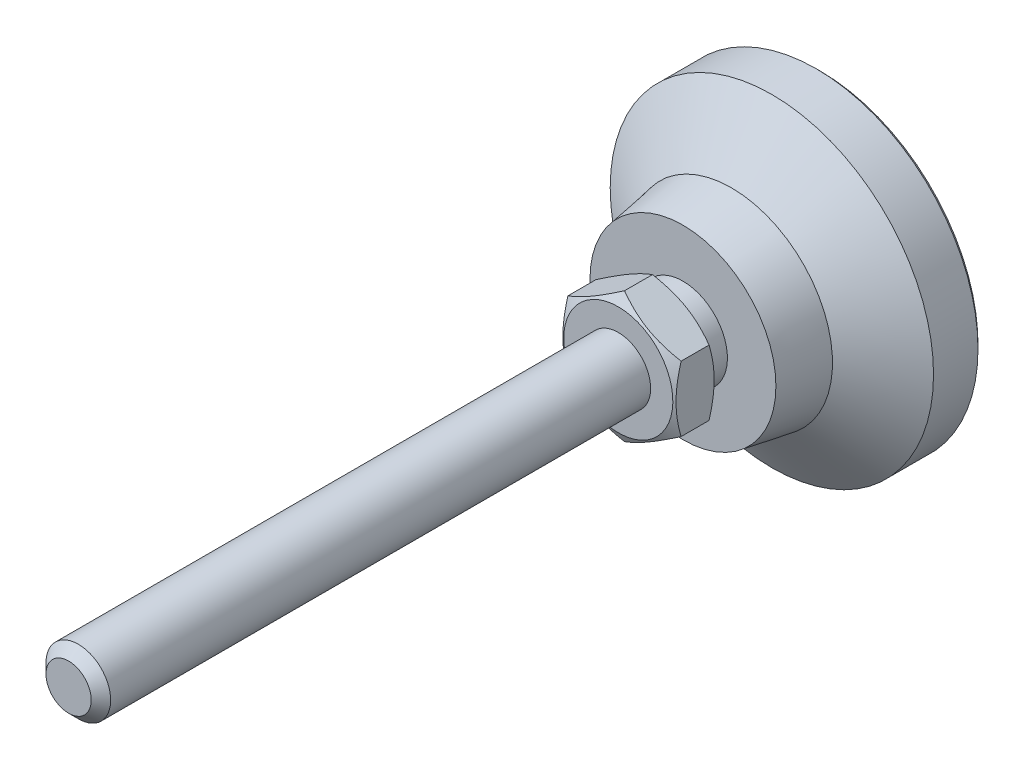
ISO-10303-21;
HEADER;
FILE_DESCRIPTION(('STEP AP214'),'2;1');
FILE_NAME('part.step','',(''),(''),'','','');
FILE_SCHEMA(('AUTOMOTIVE_DESIGN { 1 0 10303 214 1 1 1 1 }'));
ENDSEC;
DATA;
#1=APPLICATION_CONTEXT('core data for automotive mechanical design processes');
#2=APPLICATION_PROTOCOL_DEFINITION('international standard','automotive_design',2000,#1);
#3=PRODUCT_CONTEXT('',#1,'mechanical');
#4=PRODUCT('Part','Part','',(#3));
#5=PRODUCT_RELATED_PRODUCT_CATEGORY('part','',(#4));
#6=PRODUCT_DEFINITION_FORMATION('','',#4);
#7=PRODUCT_DEFINITION_CONTEXT('part definition',#1,'design');
#8=PRODUCT_DEFINITION('design','',#6,#7);
#9=PRODUCT_DEFINITION_SHAPE('','',#8);
#10=(LENGTH_UNIT() NAMED_UNIT(*) SI_UNIT(.MILLI.,.METRE.));
#11=(NAMED_UNIT(*) PLANE_ANGLE_UNIT() SI_UNIT($,.RADIAN.));
#12=(NAMED_UNIT(*) SI_UNIT($,.STERADIAN.) SOLID_ANGLE_UNIT());
#13=UNCERTAINTY_MEASURE_WITH_UNIT(LENGTH_MEASURE(1.E-05),#10,'distance_accuracy_value','');
#14=(GEOMETRIC_REPRESENTATION_CONTEXT(3) GLOBAL_UNCERTAINTY_ASSIGNED_CONTEXT((#13)) GLOBAL_UNIT_ASSIGNED_CONTEXT((#10,
#11,#12)) REPRESENTATION_CONTEXT('',''));
#15=CARTESIAN_POINT('',(0.,0.,0.));
#16=DIRECTION('',(0.,0.,1.));
#17=DIRECTION('',(1.,0.,0.));
#18=AXIS2_PLACEMENT_3D('',#15,#16,#17);
#19=CARTESIAN_POINT('',(-5.49999999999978,0.,20.));
#20=DIRECTION('',(0.,0.,1.));
#21=DIRECTION('',(0.,-1.,0.));
#22=AXIS2_PLACEMENT_3D('',#19,#20,#21);
#23=PLANE('',#22);
#24=CARTESIAN_POINT('',(0.,0.,20.));
#25=DIRECTION('',(0.,0.,-1.));
#26=DIRECTION('',(0.,1.,0.));
#27=AXIS2_PLACEMENT_3D('',#24,#25,#26);
#28=CIRCLE('',#27,5.49999999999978);
#29=CARTESIAN_POINT('',(0.,5.49999999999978,20.));
#30=VERTEX_POINT('',#29);
#31=EDGE_CURVE('E98',#30,#30,#28,.T.);
#32=ORIENTED_EDGE('',*,*,#31,.F.);
#33=EDGE_LOOP('',(#32));
#34=FACE_BOUND('',#33,.T.);
#35=CARTESIAN_POINT('',(0.,0.,20.));
#36=DIRECTION('',(0.,0.,-1.));
#37=DIRECTION('',(0.,1.,0.));
#38=AXIS2_PLACEMENT_3D('',#35,#36,#37);
#39=CIRCLE('',#38,6.75);
#40=CARTESIAN_POINT('',(0.,6.75,20.));
#41=VERTEX_POINT('',#40);
#42=EDGE_CURVE('E73',#41,#41,#39,.T.);
#43=ORIENTED_EDGE('',*,*,#42,.T.);
#44=EDGE_LOOP('',(#43));
#45=FACE_BOUND('',#44,.T.);
#46=ADVANCED_FACE('F14',(#34,#45),#23,.F.);
#47=CARTESIAN_POINT('',(0.,0.,-1.00000000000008));
#48=DIRECTION('',(0.,0.,-1.));
#49=DIRECTION('',(0.,1.,0.));
#50=AXIS2_PLACEMENT_3D('',#47,#48,#49);
#51=CYLINDRICAL_SURFACE('',#50,20.);
#52=CARTESIAN_POINT('',(0.,0.,0.500000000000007));
#53=DIRECTION('',(0.,0.,-1.));
#54=DIRECTION('',(0.,1.,0.));
#55=AXIS2_PLACEMENT_3D('',#52,#53,#54);
#56=CIRCLE('',#55,20.);
#57=CARTESIAN_POINT('',(0.,20.,0.500000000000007));
#58=VERTEX_POINT('',#57);
#59=EDGE_CURVE('E9',#58,#58,#56,.F.);
#60=ORIENTED_EDGE('',*,*,#59,.T.);
#61=EDGE_LOOP('',(#60));
#62=FACE_BOUND('',#61,.T.);
#63=CARTESIAN_POINT('',(0.,0.,6.));
#64=DIRECTION('',(0.,0.,-1.));
#65=DIRECTION('',(0.,1.,0.));
#66=AXIS2_PLACEMENT_3D('',#63,#64,#65);
#67=CIRCLE('',#66,20.);
#68=CARTESIAN_POINT('',(0.,20.,6.));
#69=VERTEX_POINT('',#68);
#70=EDGE_CURVE('E110',#69,#69,#67,.T.);
#71=ORIENTED_EDGE('',*,*,#70,.T.);
#72=EDGE_LOOP('',(#71));
#73=FACE_BOUND('',#72,.T.);
#74=ADVANCED_FACE('F131',(#62,#73),#51,.T.);
#75=CARTESIAN_POINT('',(0.,0.,11.));
#76=DIRECTION('',(0.,0.,-1.));
#77=DIRECTION('',(0.,1.,0.));
#78=AXIS2_PLACEMENT_3D('',#75,#76,#77);
#79=CONICAL_SURFACE('',#78,12.5,0.98279372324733);
#80=ORIENTED_EDGE('',*,*,#70,.F.);
#81=EDGE_LOOP('',(#80));
#82=FACE_BOUND('',#81,.T.);
#83=CARTESIAN_POINT('',(0.,0.,11.));
#84=DIRECTION('',(0.,0.,-1.));
#85=DIRECTION('',(0.,1.,0.));
#86=AXIS2_PLACEMENT_3D('',#83,#84,#85);
#87=CIRCLE('',#86,12.5);
#88=CARTESIAN_POINT('',(0.,12.5,11.));
#89=VERTEX_POINT('',#88);
#90=EDGE_CURVE('E107',#89,#89,#87,.T.);
#91=ORIENTED_EDGE('',*,*,#90,.T.);
#92=EDGE_LOOP('',(#91));
#93=FACE_BOUND('',#92,.T.);
#94=ADVANCED_FACE('F138',(#82,#93),#79,.T.);
#95=CARTESIAN_POINT('',(0.,0.,17.));
#96=DIRECTION('',(0.,0.,-1.));
#97=DIRECTION('',(0.,1.,0.));
#98=AXIS2_PLACEMENT_3D('',#95,#96,#97);
#99=CONICAL_SURFACE('',#98,11.5,0.165148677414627);
#100=ORIENTED_EDGE('',*,*,#90,.F.);
#101=EDGE_LOOP('',(#100));
#102=FACE_BOUND('',#101,.T.);
#103=CARTESIAN_POINT('',(0.,0.,17.));
#104=DIRECTION('',(0.,0.,-1.));
#105=DIRECTION('',(0.,1.,0.));
#106=AXIS2_PLACEMENT_3D('',#103,#104,#105);
#107=CIRCLE('',#106,11.5);
#108=CARTESIAN_POINT('',(0.,11.5,17.));
#109=VERTEX_POINT('',#108);
#110=EDGE_CURVE('E104',#109,#109,#107,.T.);
#111=ORIENTED_EDGE('',*,*,#110,.T.);
#112=EDGE_LOOP('',(#111));
#113=FACE_BOUND('',#112,.T.);
#114=ADVANCED_FACE('F152',(#102,#113),#99,.T.);
#115=CARTESIAN_POINT('',(-11.5,0.,17.));
#116=DIRECTION('',(0.,0.,-1.));
#117=DIRECTION('',(0.,1.,0.));
#118=AXIS2_PLACEMENT_3D('',#115,#116,#117);
#119=PLANE('',#118);
#120=ORIENTED_EDGE('',*,*,#110,.F.);
#121=EDGE_LOOP('',(#120));
#122=FACE_BOUND('',#121,.T.);
#123=CARTESIAN_POINT('',(0.,0.,17.));
#124=DIRECTION('',(0.,0.,-1.));
#125=DIRECTION('',(0.,1.,0.));
#126=AXIS2_PLACEMENT_3D('',#123,#124,#125);
#127=CIRCLE('',#126,5.49999999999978);
#128=CARTESIAN_POINT('',(0.,5.49999999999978,17.));
#129=VERTEX_POINT('',#128);
#130=EDGE_CURVE('E101',#129,#129,#127,.T.);
#131=ORIENTED_EDGE('',*,*,#130,.T.);
#132=EDGE_LOOP('',(#131));
#133=FACE_BOUND('',#132,.T.);
#134=ADVANCED_FACE('F148',(#122,#133),#119,.F.);
#135=CARTESIAN_POINT('',(0.,0.,-1.00000000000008));
#136=DIRECTION('',(0.,0.,-1.));
#137=DIRECTION('',(0.,1.,0.));
#138=AXIS2_PLACEMENT_3D('',#135,#136,#137);
#139=CYLINDRICAL_SURFACE('',#138,5.49999999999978);
#140=ORIENTED_EDGE('',*,*,#130,.F.);
#141=EDGE_LOOP('',(#140));
#142=FACE_BOUND('',#141,.T.);
#143=ORIENTED_EDGE('',*,*,#31,.T.);
#144=EDGE_LOOP('',(#143));
#145=FACE_BOUND('',#144,.T.);
#146=ADVANCED_FACE('F127',(#142,#145),#139,.T.);
#147=CARTESIAN_POINT('',(0.,0.,0.));
#148=DIRECTION('',(0.,0.,-1.));
#149=DIRECTION('',(0.,1.,0.));
#150=AXIS2_PLACEMENT_3D('',#147,#148,#149);
#151=PLANE('',#150);
#152=CARTESIAN_POINT('',(0.,0.,0.));
#153=DIRECTION('',(0.,0.,-1.));
#154=DIRECTION('',(0.,1.,0.));
#155=AXIS2_PLACEMENT_3D('',#152,#153,#154);
#156=CIRCLE('',#155,19.5);
#157=CARTESIAN_POINT('',(0.,19.5,0.));
#158=VERTEX_POINT('',#157);
#159=EDGE_CURVE('E22',#158,#158,#156,.T.);
#160=ORIENTED_EDGE('',*,*,#159,.T.);
#161=EDGE_LOOP('',(#160));
#162=FACE_BOUND('',#161,.T.);
#163=ADVANCED_FACE('F115',(#162),#151,.T.);
#164=CARTESIAN_POINT('',(0.,0.,0.));
#165=DIRECTION('',(0.,0.,1.));
#166=DIRECTION('',(0.,-1.,0.));
#167=AXIS2_PLACEMENT_3D('',#164,#165,#166);
#168=CONICAL_SURFACE('',#167,19.5,0.785398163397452);
#169=ORIENTED_EDGE('',*,*,#59,.F.);
#170=EDGE_LOOP('',(#169));
#171=FACE_BOUND('',#170,.T.);
#172=ORIENTED_EDGE('',*,*,#159,.F.);
#173=EDGE_LOOP('',(#172));
#174=FACE_BOUND('',#173,.T.);
#175=ADVANCED_FACE('F16',(#171,#174),#168,.T.);
#176=CARTESIAN_POINT('',(0.,0.,20.));
#177=DIRECTION('',(0.,0.,1.));
#178=DIRECTION('',(0.,-1.,0.));
#179=AXIS2_PLACEMENT_3D('',#176,#177,#178);
#180=CONICAL_SURFACE('',#179,6.75,1.0471975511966);
#181=CARTESIAN_POINT('',(-7.,10.8309381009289,23.5484485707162));
#182=CARTESIAN_POINT('',(-7.,10.5254090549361,23.4003398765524));
#183=CARTESIAN_POINT('',(-7.,10.2191759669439,23.2536585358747));
#184=CARTESIAN_POINT('',(-7.,9.6049271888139,22.9639538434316));
#185=CARTESIAN_POINT('',(-7.,9.29691122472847,22.8209310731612));
#186=CARTESIAN_POINT('',(-7.,8.67712322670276,22.5386219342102));
#187=CARTESIAN_POINT('',(-7.,8.36533985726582,22.3993603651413));
#188=CARTESIAN_POINT('',(-7.,7.73928460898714,22.1265696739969));
#189=CARTESIAN_POINT('',(-7.,7.42501284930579,21.9930402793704));
#190=CARTESIAN_POINT('',(-7.,6.78343496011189,21.7290953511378));
#191=CARTESIAN_POINT('',(-7.,6.45603206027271,21.5989137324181));
#192=CARTESIAN_POINT('',(-7.,5.79738748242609,21.3484635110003));
#193=CARTESIAN_POINT('',(-7.,5.46614537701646,21.228196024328));
#194=CARTESIAN_POINT('',(-7.,4.79991945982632,21.0007499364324));
#195=CARTESIAN_POINT('',(-7.,4.46494486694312,20.8935446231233));
#196=CARTESIAN_POINT('',(-7.,3.79020291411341,20.6956778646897));
#197=CARTESIAN_POINT('',(-7.,3.45043710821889,20.605011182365));
#198=CARTESIAN_POINT('',(-7.,2.7677432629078,20.4450759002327));
#199=CARTESIAN_POINT('',(-7.,2.42484292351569,20.3756922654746));
#200=CARTESIAN_POINT('',(-7.,1.90738986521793,20.290595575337));
#201=CARTESIAN_POINT('',(-7.,1.73437552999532,20.2653919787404));
#202=CARTESIAN_POINT('',(-7.,1.38749538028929,20.2218059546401));
#203=CARTESIAN_POINT('',(-7.,1.21362964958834,20.2034228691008));
#204=CARTESIAN_POINT('',(-7.,0.867540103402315,20.1740733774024));
#205=CARTESIAN_POINT('',(-7.,0.695324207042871,20.163013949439));
#206=CARTESIAN_POINT('',(-7.,0.350579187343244,20.1481859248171));
#207=CARTESIAN_POINT('',(-7.,0.178050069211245,20.1444172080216));
#208=CARTESIAN_POINT('',(-7.,-0.167013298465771,20.1442604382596));
#209=CARTESIAN_POINT('',(-7.,-0.339547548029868,20.1478724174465));
#210=CARTESIAN_POINT('',(-7.,-0.684311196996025,20.1623892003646));
#211=CARTESIAN_POINT('',(-7.,-0.856540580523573,20.1732943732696));
#212=CARTESIAN_POINT('',(-7.,-1.27121640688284,20.2081008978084));
#213=CARTESIAN_POINT('',(-7.,-1.51337499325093,20.2355046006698));
#214=CARTESIAN_POINT('',(-7.,-1.99586709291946,20.3032290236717));
#215=CARTESIAN_POINT('',(-7.,-2.23620035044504,20.3435515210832));
#216=CARTESIAN_POINT('',(-7.,-2.95420288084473,20.48175670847));
#217=CARTESIAN_POINT('',(-7.,-3.42860142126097,20.5968511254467));
#218=CARTESIAN_POINT('',(-7.,-4.13792296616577,20.7960878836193));
#219=CARTESIAN_POINT('',(-7.,-4.3765338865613,20.8678526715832));
#220=CARTESIAN_POINT('',(-7.,-4.85143755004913,21.0187495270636));
#221=CARTESIAN_POINT('',(-7.,-5.08773027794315,21.0978816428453));
#222=CARTESIAN_POINT('',(-7.,-5.55807357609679,21.2622506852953));
#223=CARTESIAN_POINT('',(-7.,-5.79212487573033,21.3474855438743));
#224=CARTESIAN_POINT('',(-7.,-6.25829408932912,21.5230658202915));
#225=CARTESIAN_POINT('',(-7.,-6.49041202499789,21.6134111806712));
#226=CARTESIAN_POINT('',(-7.,-7.03438398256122,21.8309339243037));
#227=CARTESIAN_POINT('',(-7.,-7.34553042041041,21.9598774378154));
#228=CARTESIAN_POINT('',(-7.,-7.96521129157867,22.2239128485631));
#229=CARTESIAN_POINT('',(-7.,-8.27374557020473,22.3590051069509));
#230=CARTESIAN_POINT('',(-7.,-8.88867762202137,22.6341137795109));
#231=CARTESIAN_POINT('',(-7.,-9.19507496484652,22.7741311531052));
#232=CARTESIAN_POINT('',(-7.,-9.80603817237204,23.0581132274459));
#233=CARTESIAN_POINT('',(-7.,-10.1106039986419,23.2020780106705));
#234=CARTESIAN_POINT('',(-7.,-10.7185127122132,23.4933690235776));
#235=CARTESIAN_POINT('',(-7.,-11.0218539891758,23.6406986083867));
#236=CARTESIAN_POINT('',(-7.,-11.6272367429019,23.9380068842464));
#237=CARTESIAN_POINT('',(-7.,-11.9292782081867,24.0879855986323));
#238=CARTESIAN_POINT('',(-7.,-12.8336830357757,24.5411573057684));
#239=CARTESIAN_POINT('',(-7.,-13.4344058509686,24.8476240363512));
#240=CARTESIAN_POINT('',(-7.,-14.5830259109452,25.4410667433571));
#241=CARTESIAN_POINT('',(-7.,-15.1311766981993,25.7275541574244));
#242=CARTESIAN_POINT('',(-7.,-16.2254388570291,26.3044400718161));
#243=CARTESIAN_POINT('',(-7.,-16.7715501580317,26.5948387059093));
#244=CARTESIAN_POINT('',(-7.,-17.8608477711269,27.1779057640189));
#245=CARTESIAN_POINT('',(-7.,-18.4040379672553,27.4705669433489));
#246=CARTESIAN_POINT('',(-7.,-19.4891122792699,28.0582319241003));
#247=CARTESIAN_POINT('',(-7.,-20.0309964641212,28.3532355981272));
#248=CARTESIAN_POINT('',(-7.,-20.5723989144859,28.6491148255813));
#249=B_SPLINE_CURVE_WITH_KNOTS('',3,(#181,#182,#183,#184,#185,#186,#187,#188,#189,#190,#191,
#192,#193,#194,#195,#196,#197,#198,#199,#200,#201,#202,#203,#204,#205,#206,#207,#208,#209,#210,
#211,#212,#213,#214,#215,#216,#217,#218,#219,#220,#221,#222,#223,#224,#225,#226,#227,#228,#229,
#230,#231,#232,#233,#234,#235,#236,#237,#238,#239,#240,#241,#242,#243,#244,#245,#246,#247,#248),
.UNSPECIFIED.,.F.,.F.,(4,2,2,2,2,2,2,2,2,2,2,2,2,2,2,2,2,2,2,2,2,2,2,2,2,2,2,2,2,2,2,2,2,4),(0.,
1.01861829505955,2.03739749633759,3.06176519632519,4.08608413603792,5.14296439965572,
6.19996347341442,7.2547633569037,8.30922864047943,9.35788980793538,9.88229784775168,
10.406655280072,10.924217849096,11.4417718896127,11.9593281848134,12.4769106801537,
13.2076098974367,13.9384096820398,15.400829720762,16.1482764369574,16.8957280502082,
17.6429275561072,18.3901186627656,19.4004490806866,20.4108389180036,21.4214266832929,
22.4320355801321,23.443700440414,24.4553742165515,26.4784585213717,28.3339467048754,
30.1894985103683,32.0405341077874,33.8914697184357),.UNSPECIFIED.);
#250=CARTESIAN_POINT('',(-7.,4.04145188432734,20.7695523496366));
#251=VERTEX_POINT('',#250);
#252=CARTESIAN_POINT('',(-7.,-4.04145188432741,20.7695523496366));
#253=VERTEX_POINT('',#252);
#254=EDGE_CURVE('E79',#251,#253,#249,.T.);
#255=ORIENTED_EDGE('',*,*,#254,.F.);
#256=CARTESIAN_POINT('',(0.000200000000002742,8.08301923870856,20.7696190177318));
#257=CARTESIAN_POINT('',(-0.153667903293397,7.99418356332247,20.7183374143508));
#258=CARTESIAN_POINT('',(-0.308109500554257,7.90501666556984,20.669383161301));
#259=CARTESIAN_POINT('',(-0.618246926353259,7.725958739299,20.5767703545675));
#260=CARTESIAN_POINT('',(-0.773943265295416,7.63606741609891,20.5331140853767));
#261=CARTESIAN_POINT('',(-1.24352516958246,7.36495417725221,20.4109491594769));
#262=CARTESIAN_POINT('',(-1.5592643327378,7.18266208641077,20.3414631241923));
#263=CARTESIAN_POINT('',(-2.03176224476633,6.90986528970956,20.2599825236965));
#264=CARTESIAN_POINT('',(-2.18710922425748,6.82017566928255,20.2367710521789));
#265=CARTESIAN_POINT('',(-2.49850511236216,6.64039116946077,20.1978487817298));
#266=CARTESIAN_POINT('',(-2.6545539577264,6.55029632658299,20.1821373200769));
#267=CARTESIAN_POINT('',(-2.96692267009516,6.36995016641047,20.1586154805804));
#268=CARTESIAN_POINT('',(-3.12324202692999,6.27969914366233,20.1507961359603));
#269=CARTESIAN_POINT('',(-3.43601650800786,6.09911871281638,20.1432178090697));
#270=CARTESIAN_POINT('',(-3.59247162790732,6.00878930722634,20.1434585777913));
#271=CARTESIAN_POINT('',(-4.02110687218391,5.76131663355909,20.1551972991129));
#272=CARTESIAN_POINT('',(-4.29314668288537,5.6042543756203,20.1749033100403));
#273=CARTESIAN_POINT('',(-4.83541944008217,5.29117305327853,20.2373910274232));
#274=CARTESIAN_POINT('',(-5.10565047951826,5.13515508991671,20.2801940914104));
#275=CARTESIAN_POINT('',(-5.64901454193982,4.82144370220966,20.3871892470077));
#276=CARTESIAN_POINT('',(-5.92207900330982,4.66378986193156,20.4518346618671));
#277=CARTESIAN_POINT('',(-6.46413578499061,4.35083323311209,20.5985536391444));
#278=CARTESIAN_POINT('',(-6.73313504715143,4.19552643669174,20.6805927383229));
#279=CARTESIAN_POINT('',(-7.0002,4.0413364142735,20.7696190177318));
#280=B_SPLINE_CURVE_WITH_KNOTS('',3,(#256,#257,#258,#259,#260,#261,#262,#263,#264,#265,#266,
#267,#268,#269,#270,#271,#272,#273,#274,#275,#276,#277,#278,#279),.UNSPECIFIED.,.F.,.F.,(4,2,2,
2,2,2,2,2,2,2,2,4),(0.,0.554727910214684,1.10969417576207,2.22193274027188,2.76443041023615,
3.30688013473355,3.84871284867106,4.39052882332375,5.33376515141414,6.27787517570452,
7.24292418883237,8.20607866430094),.UNSPECIFIED.);
#281=CARTESIAN_POINT('',(0.,8.08290376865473,20.7695523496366));
#282=VERTEX_POINT('',#281);
#283=EDGE_CURVE('E371',#282,#251,#280,.T.);
#284=ORIENTED_EDGE('',*,*,#283,.F.);
#285=CARTESIAN_POINT('',(7.0002,4.04133641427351,20.7696190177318));
#286=CARTESIAN_POINT('',(6.8463320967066,4.1301720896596,20.7183374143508));
#287=CARTESIAN_POINT('',(6.69189049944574,4.21933898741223,20.669383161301));
#288=CARTESIAN_POINT('',(6.38175307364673,4.39839691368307,20.5767703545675));
#289=CARTESIAN_POINT('',(6.22605673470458,4.48828823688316,20.5331140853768));
#290=CARTESIAN_POINT('',(5.75647483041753,4.75940147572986,20.4109491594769));
#291=CARTESIAN_POINT('',(5.44073566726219,4.9416935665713,20.3414631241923));
#292=CARTESIAN_POINT('',(4.96823775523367,5.21449036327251,20.2599825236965));
#293=CARTESIAN_POINT('',(4.81289077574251,5.30417998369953,20.2367710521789));
#294=CARTESIAN_POINT('',(4.50149488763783,5.4839644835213,20.1978487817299));
#295=CARTESIAN_POINT('',(4.34544604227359,5.57405932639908,20.1821373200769));
#296=CARTESIAN_POINT('',(4.03307732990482,5.7544054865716,20.1586154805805));
#297=CARTESIAN_POINT('',(3.87675797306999,5.84465650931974,20.1507961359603));
#298=CARTESIAN_POINT('',(3.56398349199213,6.02523694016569,20.1432178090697));
#299=CARTESIAN_POINT('',(3.40752837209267,6.11556634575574,20.1434585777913));
#300=CARTESIAN_POINT('',(2.97889312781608,6.36303901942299,20.1551972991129));
#301=CARTESIAN_POINT('',(2.70685331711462,6.52010127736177,20.1749033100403));
#302=CARTESIAN_POINT('',(2.16458055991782,6.83318259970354,20.2373910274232));
#303=CARTESIAN_POINT('',(1.89434952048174,6.98920056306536,20.2801940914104));
#304=CARTESIAN_POINT('',(1.35098545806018,7.30291195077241,20.3871892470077));
#305=CARTESIAN_POINT('',(1.07792099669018,7.46056579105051,20.4518346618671));
#306=CARTESIAN_POINT('',(0.535864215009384,7.77352241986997,20.5985536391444));
#307=CARTESIAN_POINT('',(0.266864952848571,7.92882921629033,20.6805927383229));
#308=CARTESIAN_POINT('',(-0.000199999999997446,8.08301923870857,20.7696190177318));
#309=B_SPLINE_CURVE_WITH_KNOTS('',3,(#285,#286,#287,#288,#289,#290,#291,#292,#293,#294,#295,
#296,#297,#298,#299,#300,#301,#302,#303,#304,#305,#306,#307,#308),.UNSPECIFIED.,.F.,.F.,(4,2,2,
2,2,2,2,2,2,2,2,4),(0.,0.554727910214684,1.10969417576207,2.22193274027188,2.76443041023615,
3.30688013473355,3.84871284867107,4.39052882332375,5.33376515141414,6.27787517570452,
7.24292418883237,8.20607866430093),.UNSPECIFIED.);
#310=CARTESIAN_POINT('',(7.,4.04145188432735,20.7695523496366));
#311=VERTEX_POINT('',#310);
#312=EDGE_CURVE('E366',#311,#282,#309,.T.);
#313=ORIENTED_EDGE('',*,*,#312,.F.);
#314=CARTESIAN_POINT('',(7.,10.8309381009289,23.5484485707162));
#315=CARTESIAN_POINT('',(7.,10.5254090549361,23.4003398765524));
#316=CARTESIAN_POINT('',(7.,10.2191759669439,23.2536585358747));
#317=CARTESIAN_POINT('',(7.,9.60492718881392,22.9639538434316));
#318=CARTESIAN_POINT('',(7.,9.29691122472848,22.8209310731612));
#319=CARTESIAN_POINT('',(7.,8.67712322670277,22.5386219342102));
#320=CARTESIAN_POINT('',(7.,8.36533985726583,22.3993603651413));
#321=CARTESIAN_POINT('',(7.,7.73928460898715,22.1265696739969));
#322=CARTESIAN_POINT('',(7.,7.4250128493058,21.9930402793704));
#323=CARTESIAN_POINT('',(7.,6.7834349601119,21.7290953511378));
#324=CARTESIAN_POINT('',(7.,6.45603206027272,21.5989137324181));
#325=CARTESIAN_POINT('',(7.,5.79738748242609,21.3484635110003));
#326=CARTESIAN_POINT('',(7.,5.46614537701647,21.228196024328));
#327=CARTESIAN_POINT('',(7.,4.79991945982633,21.0007499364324));
#328=CARTESIAN_POINT('',(7.,4.46494486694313,20.8935446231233));
#329=CARTESIAN_POINT('',(7.,3.79020291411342,20.6956778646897));
#330=CARTESIAN_POINT('',(7.,3.4504371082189,20.605011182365));
#331=CARTESIAN_POINT('',(7.,2.76774326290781,20.4450759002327));
#332=CARTESIAN_POINT('',(7.,2.42484292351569,20.3756922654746));
#333=CARTESIAN_POINT('',(7.,1.90738986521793,20.290595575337));
#334=CARTESIAN_POINT('',(7.,1.73437552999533,20.2653919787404));
#335=CARTESIAN_POINT('',(7.,1.38749538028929,20.2218059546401));
#336=CARTESIAN_POINT('',(7.,1.21362964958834,20.2034228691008));
#337=CARTESIAN_POINT('',(7.,0.86754010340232,20.1740733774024));
#338=CARTESIAN_POINT('',(7.,0.695324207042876,20.163013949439));
#339=CARTESIAN_POINT('',(7.,0.350579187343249,20.1481859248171));
#340=CARTESIAN_POINT('',(7.,0.178050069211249,20.1444172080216));
#341=CARTESIAN_POINT('',(7.,-0.167013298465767,20.1442604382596));
#342=CARTESIAN_POINT('',(7.,-0.339547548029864,20.1478724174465));
#343=CARTESIAN_POINT('',(7.,-0.684311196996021,20.1623892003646));
#344=CARTESIAN_POINT('',(7.,-0.856540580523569,20.1732943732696));
#345=CARTESIAN_POINT('',(7.,-1.27121640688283,20.2081008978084));
#346=CARTESIAN_POINT('',(7.,-1.51337499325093,20.2355046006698));
#347=CARTESIAN_POINT('',(7.,-1.99586709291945,20.3032290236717));
#348=CARTESIAN_POINT('',(7.,-2.23620035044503,20.3435515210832));
#349=CARTESIAN_POINT('',(7.,-2.95420288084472,20.48175670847));
#350=CARTESIAN_POINT('',(7.,-3.42860142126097,20.5968511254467));
#351=CARTESIAN_POINT('',(7.,-4.13792296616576,20.7960878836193));
#352=CARTESIAN_POINT('',(7.,-4.37653388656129,20.8678526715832));
#353=CARTESIAN_POINT('',(7.,-4.85143755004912,21.0187495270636));
#354=CARTESIAN_POINT('',(7.,-5.08773027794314,21.0978816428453));
#355=CARTESIAN_POINT('',(7.,-5.55807357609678,21.2622506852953));
#356=CARTESIAN_POINT('',(7.,-5.79212487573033,21.3474855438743));
#357=CARTESIAN_POINT('',(7.,-6.25829408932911,21.5230658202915));
#358=CARTESIAN_POINT('',(7.,-6.49041202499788,21.6134111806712));
#359=CARTESIAN_POINT('',(7.,-7.03438398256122,21.8309339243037));
#360=CARTESIAN_POINT('',(7.,-7.34553042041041,21.9598774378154));
#361=CARTESIAN_POINT('',(7.,-7.96521129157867,22.2239128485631));
#362=CARTESIAN_POINT('',(7.,-8.27374557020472,22.3590051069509));
#363=CARTESIAN_POINT('',(7.,-8.88867762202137,22.6341137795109));
#364=CARTESIAN_POINT('',(7.,-9.19507496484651,22.7741311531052));
#365=CARTESIAN_POINT('',(7.,-9.80603817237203,23.0581132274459));
#366=CARTESIAN_POINT('',(7.,-10.1106039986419,23.2020780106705));
#367=CARTESIAN_POINT('',(7.,-10.7185127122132,23.4933690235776));
#368=CARTESIAN_POINT('',(7.,-11.0218539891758,23.6406986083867));
#369=CARTESIAN_POINT('',(7.,-11.6272367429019,23.9380068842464));
#370=CARTESIAN_POINT('',(7.,-11.9292782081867,24.0879855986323));
#371=CARTESIAN_POINT('',(7.,-12.8336830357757,24.5411573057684));
#372=CARTESIAN_POINT('',(7.,-13.4344058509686,24.8476240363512));
#373=CARTESIAN_POINT('',(7.,-14.5830259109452,25.4410667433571));
#374=CARTESIAN_POINT('',(7.,-15.1311766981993,25.7275541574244));
#375=CARTESIAN_POINT('',(7.,-16.2254388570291,26.3044400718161));
#376=CARTESIAN_POINT('',(7.,-16.7715501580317,26.5948387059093));
#377=CARTESIAN_POINT('',(7.,-17.8608477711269,27.1779057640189));
#378=CARTESIAN_POINT('',(7.,-18.4040379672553,27.4705669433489));
#379=CARTESIAN_POINT('',(7.,-19.4891122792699,28.0582319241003));
#380=CARTESIAN_POINT('',(7.,-20.0309964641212,28.3532355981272));
#381=CARTESIAN_POINT('',(7.,-20.5723989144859,28.6491148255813));
#382=B_SPLINE_CURVE_WITH_KNOTS('',3,(#314,#315,#316,#317,#318,#319,#320,#321,#322,#323,#324,
#325,#326,#327,#328,#329,#330,#331,#332,#333,#334,#335,#336,#337,#338,#339,#340,#341,#342,#343,
#344,#345,#346,#347,#348,#349,#350,#351,#352,#353,#354,#355,#356,#357,#358,#359,#360,#361,#362,
#363,#364,#365,#366,#367,#368,#369,#370,#371,#372,#373,#374,#375,#376,#377,#378,#379,#380,#381),
.UNSPECIFIED.,.F.,.F.,(4,2,2,2,2,2,2,2,2,2,2,2,2,2,2,2,2,2,2,2,2,2,2,2,2,2,2,2,2,2,2,2,2,4),(0.,
1.01861829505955,2.03739749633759,3.0617651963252,4.08608413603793,5.14296439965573,
6.19996347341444,7.25476335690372,8.30922864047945,9.3578898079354,9.88229784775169,
10.406655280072,10.924217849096,11.4417718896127,11.9593281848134,12.4769106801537,
13.2076098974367,13.9384096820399,15.400829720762,16.1482764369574,16.8957280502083,
17.6429275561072,18.3901186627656,19.4004490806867,20.4108389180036,21.4214266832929,
22.4320355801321,23.443700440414,24.4553742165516,26.4784585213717,28.3339467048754,
30.1894985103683,32.0405341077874,33.8914697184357),.UNSPECIFIED.);
#383=CARTESIAN_POINT('',(7.,-4.04145188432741,20.7695523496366));
#384=VERTEX_POINT('',#383);
#385=EDGE_CURVE('E29',#384,#311,#382,.F.);
#386=ORIENTED_EDGE('',*,*,#385,.F.);
#387=CARTESIAN_POINT('',(-0.000199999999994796,-8.08301923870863,20.7696190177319));
#388=CARTESIAN_POINT('',(0.153667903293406,-7.99418356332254,20.7183374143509));
#389=CARTESIAN_POINT('',(0.308109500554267,-7.90501666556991,20.669383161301));
#390=CARTESIAN_POINT('',(0.618246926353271,-7.72595873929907,20.5767703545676));
#391=CARTESIAN_POINT('',(0.77394326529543,-7.63606741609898,20.5331140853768));
#392=CARTESIAN_POINT('',(1.24352516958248,-7.36495417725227,20.4109491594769));
#393=CARTESIAN_POINT('',(1.55926433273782,-7.18266208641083,20.3414631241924));
#394=CARTESIAN_POINT('',(2.03176224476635,-6.90986528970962,20.2599825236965));
#395=CARTESIAN_POINT('',(2.18710922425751,-6.82017566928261,20.2367710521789));
#396=CARTESIAN_POINT('',(2.49850511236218,-6.64039116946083,20.1978487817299));
#397=CARTESIAN_POINT('',(2.65455395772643,-6.55029632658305,20.1821373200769));
#398=CARTESIAN_POINT('',(2.9669226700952,-6.36995016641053,20.1586154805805));
#399=CARTESIAN_POINT('',(3.12324202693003,-6.27969914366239,20.1507961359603));
#400=CARTESIAN_POINT('',(3.43601650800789,-6.09911871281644,20.1432178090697));
#401=CARTESIAN_POINT('',(3.59247162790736,-6.00878930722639,20.1434585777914));
#402=CARTESIAN_POINT('',(4.02110687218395,-5.76131663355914,20.1551972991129));
#403=CARTESIAN_POINT('',(4.29314668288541,-5.60425437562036,20.1749033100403));
#404=CARTESIAN_POINT('',(4.8354194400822,-5.29117305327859,20.2373910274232));
#405=CARTESIAN_POINT('',(5.10565047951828,-5.13515508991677,20.2801940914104));
#406=CARTESIAN_POINT('',(5.64901454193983,-4.82144370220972,20.3871892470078));
#407=CARTESIAN_POINT('',(5.92207900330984,-4.66378986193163,20.4518346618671));
#408=CARTESIAN_POINT('',(6.46413578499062,-4.35083323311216,20.5985536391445));
#409=CARTESIAN_POINT('',(6.73313504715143,-4.19552643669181,20.680592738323));
#410=CARTESIAN_POINT('',(7.0002,-4.04133641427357,20.7696190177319));
#411=B_SPLINE_CURVE_WITH_KNOTS('',3,(#387,#388,#389,#390,#391,#392,#393,#394,#395,#396,#397,
#398,#399,#400,#401,#402,#403,#404,#405,#406,#407,#408,#409,#410),.UNSPECIFIED.,.F.,.F.,(4,2,2,
2,2,2,2,2,2,2,2,4),(0.,0.554727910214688,1.10969417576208,2.2219327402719,2.76443041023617,
3.30688013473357,3.8487128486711,4.39052882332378,5.33376515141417,6.27787517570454,
7.24292418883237,8.20607866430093),.UNSPECIFIED.);
#412=CARTESIAN_POINT('',(0.,-8.08290376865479,20.7695523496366));
#413=VERTEX_POINT('',#412);
#414=EDGE_CURVE('E66',#413,#384,#411,.T.);
#415=ORIENTED_EDGE('',*,*,#414,.F.);
#416=CARTESIAN_POINT('',(-7.0002,-4.04133641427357,20.7696190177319));
#417=CARTESIAN_POINT('',(-6.8463320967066,-4.13017208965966,20.7183374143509));
#418=CARTESIAN_POINT('',(-6.69189049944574,-4.21933898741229,20.669383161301));
#419=CARTESIAN_POINT('',(-6.38175307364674,-4.39839691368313,20.5767703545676));
#420=CARTESIAN_POINT('',(-6.22605673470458,-4.48828823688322,20.5331140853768));
#421=CARTESIAN_POINT('',(-5.75647483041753,-4.75940147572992,20.4109491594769));
#422=CARTESIAN_POINT('',(-5.44073566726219,-4.94169356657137,20.3414631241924));
#423=CARTESIAN_POINT('',(-4.96823775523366,-5.21449036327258,20.2599825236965));
#424=CARTESIAN_POINT('',(-4.8128907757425,-5.30417998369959,20.2367710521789));
#425=CARTESIAN_POINT('',(-4.50149488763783,-5.48396448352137,20.1978487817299));
#426=CARTESIAN_POINT('',(-4.34544604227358,-5.57405932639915,20.1821373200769));
#427=CARTESIAN_POINT('',(-4.03307732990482,-5.75440548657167,20.1586154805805));
#428=CARTESIAN_POINT('',(-3.87675797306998,-5.84465650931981,20.1507961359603));
#429=CARTESIAN_POINT('',(-3.56398349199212,-6.02523694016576,20.1432178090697));
#430=CARTESIAN_POINT('',(-3.40752837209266,-6.11556634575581,20.1434585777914));
#431=CARTESIAN_POINT('',(-2.97889312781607,-6.36303901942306,20.1551972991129));
#432=CARTESIAN_POINT('',(-2.7068533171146,-6.52010127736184,20.1749033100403));
#433=CARTESIAN_POINT('',(-2.16458055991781,-6.83318259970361,20.2373910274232));
#434=CARTESIAN_POINT('',(-1.89434952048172,-6.98920056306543,20.2801940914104));
#435=CARTESIAN_POINT('',(-1.35098545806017,-7.30291195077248,20.3871892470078));
#436=CARTESIAN_POINT('',(-1.07792099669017,-7.46056579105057,20.4518346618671));
#437=CARTESIAN_POINT('',(-0.535864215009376,-7.77352241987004,20.5985536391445));
#438=CARTESIAN_POINT('',(-0.266864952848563,-7.92882921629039,20.680592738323));
#439=CARTESIAN_POINT('',(0.000200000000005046,-8.08301923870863,20.7696190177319));
#440=B_SPLINE_CURVE_WITH_KNOTS('',3,(#416,#417,#418,#419,#420,#421,#422,#423,#424,#425,#426,
#427,#428,#429,#430,#431,#432,#433,#434,#435,#436,#437,#438,#439),.UNSPECIFIED.,.F.,.F.,(4,2,2,
2,2,2,2,2,2,2,2,4),(0.,0.554727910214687,1.10969417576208,2.22193274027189,2.76443041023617,
3.30688013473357,3.84871284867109,4.39052882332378,5.33376515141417,6.27787517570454,
7.24292418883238,8.20607866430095),.UNSPECIFIED.);
#441=EDGE_CURVE('E69',#253,#413,#440,.T.);
#442=ORIENTED_EDGE('',*,*,#441,.F.);
#443=EDGE_LOOP('',(#255,#284,#313,#386,#415,#442));
#444=FACE_BOUND('',#443,.T.);
#445=ORIENTED_EDGE('',*,*,#42,.F.);
#446=EDGE_LOOP('',(#445));
#447=FACE_BOUND('',#446,.T.);
#448=ADVANCED_FACE('F67',(#444,#447),#180,.T.);
#449=CARTESIAN_POINT('',(0.,0.,93.));
#450=DIRECTION('',(0.,0.,-1.));
#451=DIRECTION('',(0.,1.,0.));
#452=AXIS2_PLACEMENT_3D('',#449,#450,#451);
#453=PLANE('',#452);
#454=CARTESIAN_POINT('',(0.,0.,93.));
#455=DIRECTION('',(0.,0.,-1.));
#456=DIRECTION('',(0.,1.,0.));
#457=AXIS2_PLACEMENT_3D('',#454,#455,#456);
#458=CIRCLE('',#457,2.79999999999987);
#459=CARTESIAN_POINT('',(0.,2.79999999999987,93.));
#460=VERTEX_POINT('',#459);
#461=EDGE_CURVE('E86',#460,#460,#458,.T.);
#462=ORIENTED_EDGE('',*,*,#461,.F.);
#463=EDGE_LOOP('',(#462));
#464=FACE_BOUND('',#463,.T.);
#465=ADVANCED_FACE('F125',(#464),#453,.F.);
#466=CARTESIAN_POINT('',(0.,0.,93.));
#467=DIRECTION('',(0.,0.,-1.));
#468=DIRECTION('',(0.,1.,0.));
#469=AXIS2_PLACEMENT_3D('',#466,#467,#468);
#470=CONICAL_SURFACE('',#469,2.79999999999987,0.785398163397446);
#471=CARTESIAN_POINT('',(0.,0.,91.8));
#472=DIRECTION('',(0.,0.,-1.));
#473=DIRECTION('',(0.,1.,0.));
#474=AXIS2_PLACEMENT_3D('',#471,#472,#473);
#475=CIRCLE('',#474,3.99999999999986);
#476=CARTESIAN_POINT('',(0.,3.99999999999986,91.8));
#477=VERTEX_POINT('',#476);
#478=EDGE_CURVE('E91',#477,#477,#475,.T.);
#479=ORIENTED_EDGE('',*,*,#478,.F.);
#480=EDGE_LOOP('',(#479));
#481=FACE_BOUND('',#480,.T.);
#482=ORIENTED_EDGE('',*,*,#461,.T.);
#483=EDGE_LOOP('',(#482));
#484=FACE_BOUND('',#483,.T.);
#485=ADVANCED_FACE('F229',(#481,#484),#470,.T.);
#486=CARTESIAN_POINT('',(0.,0.,-1.00000000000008));
#487=DIRECTION('',(0.,0.,-1.));
#488=DIRECTION('',(0.,1.,0.));
#489=AXIS2_PLACEMENT_3D('',#486,#487,#488);
#490=CYLINDRICAL_SURFACE('',#489,3.99999999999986);
#491=CARTESIAN_POINT('',(0.,0.,25.));
#492=DIRECTION('',(0.,0.,-1.));
#493=DIRECTION('',(0.,1.,0.));
#494=AXIS2_PLACEMENT_3D('',#491,#492,#493);
#495=CIRCLE('',#494,3.99999999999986);
#496=CARTESIAN_POINT('',(0.,3.99999999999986,25.));
#497=VERTEX_POINT('',#496);
#498=EDGE_CURVE('E95',#497,#497,#495,.T.);
#499=ORIENTED_EDGE('',*,*,#498,.F.);
#500=EDGE_LOOP('',(#499));
#501=FACE_BOUND('',#500,.T.);
#502=ORIENTED_EDGE('',*,*,#478,.T.);
#503=EDGE_LOOP('',(#502));
#504=FACE_BOUND('',#503,.T.);
#505=ADVANCED_FACE('F237',(#501,#504),#490,.T.);
#506=CARTESIAN_POINT('',(-3.99999999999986,0.,25.));
#507=DIRECTION('',(0.,0.,-1.));
#508=DIRECTION('',(0.,1.,0.));
#509=AXIS2_PLACEMENT_3D('',#506,#507,#508);
#510=PLANE('',#509);
#511=ORIENTED_EDGE('',*,*,#498,.T.);
#512=EDGE_LOOP('',(#511));
#513=FACE_BOUND('',#512,.T.);
#514=CARTESIAN_POINT('',(0.,0.,25.));
#515=DIRECTION('',(0.,0.,-1.));
#516=DIRECTION('',(0.,1.,0.));
#517=AXIS2_PLACEMENT_3D('',#514,#515,#516);
#518=CIRCLE('',#517,6.75);
#519=CARTESIAN_POINT('',(0.,6.75,25.));
#520=VERTEX_POINT('',#519);
#521=EDGE_CURVE('E78',#520,#520,#518,.T.);
#522=ORIENTED_EDGE('',*,*,#521,.F.);
#523=EDGE_LOOP('',(#522));
#524=FACE_BOUND('',#523,.T.);
#525=ADVANCED_FACE('F144',(#513,#524),#510,.F.);
#526=CARTESIAN_POINT('',(0.,0.,23.2785790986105));
#527=DIRECTION('',(0.,0.,-1.));
#528=DIRECTION('',(0.,1.,0.));
#529=AXIS2_PLACEMENT_3D('',#526,#527,#528);
#530=CONICAL_SURFACE('',#529,9.73158846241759,1.0471975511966);
#531=CARTESIAN_POINT('',(7.0002,-4.04133641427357,24.230380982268));
#532=CARTESIAN_POINT('',(6.84633209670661,-4.13017208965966,24.281662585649));
#533=CARTESIAN_POINT('',(6.69189049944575,-4.21933898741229,24.3306168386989));
#534=CARTESIAN_POINT('',(6.38175307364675,-4.39839691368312,24.4232296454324));
#535=CARTESIAN_POINT('',(6.22605673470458,-4.48828823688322,24.4668859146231));
#536=CARTESIAN_POINT('',(5.75647483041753,-4.75940147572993,24.589050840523));
#537=CARTESIAN_POINT('',(5.4407356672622,-4.94169356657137,24.6585368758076));
#538=CARTESIAN_POINT('',(4.96823775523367,-5.21449036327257,24.7400174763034));
#539=CARTESIAN_POINT('',(4.81289077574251,-5.30417998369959,24.763228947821));
#540=CARTESIAN_POINT('',(4.50149488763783,-5.48396448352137,24.80215121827));
#541=CARTESIAN_POINT('',(4.34544604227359,-5.57405932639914,24.817862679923));
#542=CARTESIAN_POINT('',(4.03307732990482,-5.75440548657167,24.8413845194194));
#543=CARTESIAN_POINT('',(3.87675797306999,-5.84465650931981,24.8492038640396));
#544=CARTESIAN_POINT('',(3.56398349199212,-6.02523694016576,24.8567821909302));
#545=CARTESIAN_POINT('',(3.40752837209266,-6.11556634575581,24.8565414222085));
#546=CARTESIAN_POINT('',(2.97889312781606,-6.36303901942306,24.8448027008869));
#547=CARTESIAN_POINT('',(2.7068533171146,-6.52010127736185,24.8250966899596));
#548=CARTESIAN_POINT('',(2.1645805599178,-6.83318259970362,24.7626089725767));
#549=CARTESIAN_POINT('',(1.89434952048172,-6.98920056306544,24.7198059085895));
#550=CARTESIAN_POINT('',(1.35098545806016,-7.30291195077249,24.6128107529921));
#551=CARTESIAN_POINT('',(1.07792099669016,-7.46056579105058,24.5481653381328));
#552=CARTESIAN_POINT('',(0.535864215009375,-7.77352241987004,24.4014463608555));
#553=CARTESIAN_POINT('',(0.266864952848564,-7.9288292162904,24.3194072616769));
#554=CARTESIAN_POINT('',(-0.000199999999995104,-8.08301923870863,24.230380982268));
#555=B_SPLINE_CURVE_WITH_KNOTS('',3,(#531,#532,#533,#534,#535,#536,#537,#538,#539,#540,#541,
#542,#543,#544,#545,#546,#547,#548,#549,#550,#551,#552,#553,#554),.UNSPECIFIED.,.F.,.F.,(4,2,2,
2,2,2,2,2,2,2,2,4),(0.,0.554727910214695,1.10969417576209,2.2219327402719,2.76443041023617,
3.30688013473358,3.8487128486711,4.3905288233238,5.33376515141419,6.27787517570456,
7.2429241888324,8.20607866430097),.UNSPECIFIED.);
#556=CARTESIAN_POINT('',(7.,-4.04145188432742,24.2304476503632));
#557=VERTEX_POINT('',#556);
#558=CARTESIAN_POINT('',(0.,-8.08290376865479,24.2304476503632));
#559=VERTEX_POINT('',#558);
#560=EDGE_CURVE('E84',#557,#559,#555,.T.);
#561=ORIENTED_EDGE('',*,*,#560,.F.);
#562=CARTESIAN_POINT('',(7.,10.8309381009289,21.4515514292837));
#563=CARTESIAN_POINT('',(7.,10.5254090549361,21.5996601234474));
#564=CARTESIAN_POINT('',(7.,10.2191759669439,21.7463414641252));
#565=CARTESIAN_POINT('',(7.,9.60492718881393,22.0360461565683));
#566=CARTESIAN_POINT('',(7.,9.29691122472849,22.1790689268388));
#567=CARTESIAN_POINT('',(7.,8.67712322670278,22.4613780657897));
#568=CARTESIAN_POINT('',(7.,8.36533985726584,22.6006396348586));
#569=CARTESIAN_POINT('',(7.,7.73928460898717,22.873430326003));
#570=CARTESIAN_POINT('',(7.,7.42501284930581,23.0069597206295));
#571=CARTESIAN_POINT('',(7.,6.78343496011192,23.2709046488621));
#572=CARTESIAN_POINT('',(7.,6.45603206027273,23.4010862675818));
#573=CARTESIAN_POINT('',(7.,5.79738748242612,23.6515364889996));
#574=CARTESIAN_POINT('',(7.,5.46614537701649,23.7718039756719));
#575=CARTESIAN_POINT('',(7.,4.79991945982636,23.9992500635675));
#576=CARTESIAN_POINT('',(7.,4.46494486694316,24.1064553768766));
#577=CARTESIAN_POINT('',(7.,3.79020291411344,24.3043221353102));
#578=CARTESIAN_POINT('',(7.,3.4504371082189,24.3949888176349));
#579=CARTESIAN_POINT('',(7.,2.7677432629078,24.5549240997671));
#580=CARTESIAN_POINT('',(7.,2.4248429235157,24.6243077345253));
#581=CARTESIAN_POINT('',(7.,1.90738986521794,24.7094044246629));
#582=CARTESIAN_POINT('',(7.,1.73437552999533,24.7346080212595));
#583=CARTESIAN_POINT('',(7.,1.3874953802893,24.7781940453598));
#584=CARTESIAN_POINT('',(7.,1.21362964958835,24.7965771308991));
#585=CARTESIAN_POINT('',(7.,0.867540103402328,24.8259266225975));
#586=CARTESIAN_POINT('',(7.,0.695324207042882,24.8369860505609));
#587=CARTESIAN_POINT('',(7.,0.350579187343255,24.8518140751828));
#588=CARTESIAN_POINT('',(7.,0.178050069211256,24.8555827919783));
#589=CARTESIAN_POINT('',(7.,-0.167013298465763,24.8557395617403));
#590=CARTESIAN_POINT('',(7.,-0.339547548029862,24.8521275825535));
#591=CARTESIAN_POINT('',(7.,-0.684311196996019,24.8376107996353));
#592=CARTESIAN_POINT('',(7.,-0.856540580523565,24.8267056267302));
#593=CARTESIAN_POINT('',(7.,-1.27121640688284,24.7918991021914));
#594=CARTESIAN_POINT('',(7.,-1.51337499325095,24.7644953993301));
#595=CARTESIAN_POINT('',(7.,-1.99586709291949,24.6967709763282));
#596=CARTESIAN_POINT('',(7.,-2.23620035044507,24.6564484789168));
#597=CARTESIAN_POINT('',(7.,-2.95420288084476,24.5182432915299));
#598=CARTESIAN_POINT('',(7.,-3.428601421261,24.4031488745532));
#599=CARTESIAN_POINT('',(7.,-4.1379229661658,24.2039121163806));
#600=CARTESIAN_POINT('',(7.,-4.37653388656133,24.1321473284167));
#601=CARTESIAN_POINT('',(7.,-4.85143755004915,23.9812504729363));
#602=CARTESIAN_POINT('',(7.,-5.08773027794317,23.9021183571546));
#603=CARTESIAN_POINT('',(7.,-5.55807357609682,23.7377493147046));
#604=CARTESIAN_POINT('',(7.,-5.79212487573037,23.6525144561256));
#605=CARTESIAN_POINT('',(7.,-6.25829408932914,23.4769341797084));
#606=CARTESIAN_POINT('',(7.,-6.49041202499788,23.3865888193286));
#607=CARTESIAN_POINT('',(7.,-7.03438398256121,23.1690660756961));
#608=CARTESIAN_POINT('',(7.,-7.34553042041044,23.0401225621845));
#609=CARTESIAN_POINT('',(7.,-7.96521129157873,22.7760871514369));
#610=CARTESIAN_POINT('',(7.,-8.27374557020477,22.640994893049));
#611=CARTESIAN_POINT('',(7.,-8.88867762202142,22.365886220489));
#612=CARTESIAN_POINT('',(7.,-9.19507496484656,22.2258688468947));
#613=CARTESIAN_POINT('',(7.,-9.80603817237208,21.941886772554));
#614=CARTESIAN_POINT('',(7.,-10.110603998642,21.7979219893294));
#615=CARTESIAN_POINT('',(7.,-10.7185127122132,21.5066309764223));
#616=CARTESIAN_POINT('',(7.,-11.0218539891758,21.3593013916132));
#617=CARTESIAN_POINT('',(7.,-11.627236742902,21.0619931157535));
#618=CARTESIAN_POINT('',(7.,-11.9292782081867,20.9120144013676));
#619=CARTESIAN_POINT('',(7.,-12.8336830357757,20.4588426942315));
#620=CARTESIAN_POINT('',(7.,-13.4344058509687,20.1523759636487));
#621=CARTESIAN_POINT('',(7.,-14.5830259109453,19.5589332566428));
#622=CARTESIAN_POINT('',(7.,-15.1311766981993,19.2724458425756));
#623=CARTESIAN_POINT('',(7.,-16.2254388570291,18.6955599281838));
#624=CARTESIAN_POINT('',(7.,-16.7715501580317,18.4051612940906));
#625=CARTESIAN_POINT('',(7.,-17.8608477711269,17.822094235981));
#626=CARTESIAN_POINT('',(7.,-18.4040379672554,17.529433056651));
#627=CARTESIAN_POINT('',(7.,-19.4891122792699,16.9417680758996));
#628=CARTESIAN_POINT('',(7.,-20.0309964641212,16.6467644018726));
#629=CARTESIAN_POINT('',(7.,-20.5723989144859,16.3508851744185));
#630=B_SPLINE_CURVE_WITH_KNOTS('',3,(#562,#563,#564,#565,#566,#567,#568,#569,#570,#571,#572,
#573,#574,#575,#576,#577,#578,#579,#580,#581,#582,#583,#584,#585,#586,#587,#588,#589,#590,#591,
#592,#593,#594,#595,#596,#597,#598,#599,#600,#601,#602,#603,#604,#605,#606,#607,#608,#609,#610,
#611,#612,#613,#614,#615,#616,#617,#618,#619,#620,#621,#622,#623,#624,#625,#626,#627,#628,#629),
.UNSPECIFIED.,.F.,.F.,(4,2,2,2,2,2,2,2,2,2,2,2,2,2,2,2,2,2,2,2,2,2,2,2,2,2,2,2,2,2,2,2,2,4),(0.,
1.01861829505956,2.03739749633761,3.06176519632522,4.08608413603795,5.14296439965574,
6.19996347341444,7.25476335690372,8.30922864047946,9.35788980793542,9.88229784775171,
10.406655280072,10.924217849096,11.4417718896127,11.9593281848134,12.4769106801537,
13.2076098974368,13.9384096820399,15.4008297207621,16.1482764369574,16.8957280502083,
17.6429275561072,18.3901186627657,19.4004490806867,20.4108389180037,21.421426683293,
22.4320355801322,23.4437004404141,24.4553742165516,26.4784585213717,28.3339467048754,
30.1894985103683,32.0405341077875,33.8914697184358),.UNSPECIFIED.);
#631=CARTESIAN_POINT('',(7.,4.04145188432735,24.2304476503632));
#632=VERTEX_POINT('',#631);
#633=EDGE_CURVE('E414',#632,#557,#630,.T.);
#634=ORIENTED_EDGE('',*,*,#633,.F.);
#635=CARTESIAN_POINT('',(-0.000199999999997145,8.08301923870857,24.2303809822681));
#636=CARTESIAN_POINT('',(0.153667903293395,7.99418356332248,24.2816625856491));
#637=CARTESIAN_POINT('',(0.308109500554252,7.90501666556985,24.3306168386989));
#638=CARTESIAN_POINT('',(0.618246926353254,7.72595873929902,24.4232296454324));
#639=CARTESIAN_POINT('',(0.773943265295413,7.63606741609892,24.4668859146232));
#640=CARTESIAN_POINT('',(1.24352516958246,7.36495417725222,24.589050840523));
#641=CARTESIAN_POINT('',(1.55926433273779,7.18266208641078,24.6585368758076));
#642=CARTESIAN_POINT('',(2.03176224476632,6.90986528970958,24.7400174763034));
#643=CARTESIAN_POINT('',(2.18710922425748,6.82017566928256,24.7632289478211));
#644=CARTESIAN_POINT('',(2.49850511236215,6.64039116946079,24.8021512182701));
#645=CARTESIAN_POINT('',(2.6545539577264,6.55029632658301,24.817862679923));
#646=CARTESIAN_POINT('',(2.96692267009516,6.36995016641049,24.8413845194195));
#647=CARTESIAN_POINT('',(3.12324202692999,6.27969914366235,24.8492038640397));
#648=CARTESIAN_POINT('',(3.43601650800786,6.0991187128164,24.8567821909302));
#649=CARTESIAN_POINT('',(3.59247162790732,6.00878930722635,24.8565414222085));
#650=CARTESIAN_POINT('',(4.02110687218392,5.7613166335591,24.8448027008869));
#651=CARTESIAN_POINT('',(4.29314668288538,5.60425437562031,24.8250966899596));
#652=CARTESIAN_POINT('',(4.83541944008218,5.29117305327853,24.7626089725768));
#653=CARTESIAN_POINT('',(5.10565047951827,5.13515508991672,24.7198059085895));
#654=CARTESIAN_POINT('',(5.64901454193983,4.82144370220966,24.6128107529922));
#655=CARTESIAN_POINT('',(5.92207900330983,4.66378986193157,24.5481653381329));
#656=CARTESIAN_POINT('',(6.46413578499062,4.3508332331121,24.4014463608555));
#657=CARTESIAN_POINT('',(6.73313504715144,4.19552643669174,24.319407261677));
#658=CARTESIAN_POINT('',(7.0002,4.04133641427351,24.2303809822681));
#659=B_SPLINE_CURVE_WITH_KNOTS('',3,(#635,#636,#637,#638,#639,#640,#641,#642,#643,#644,#645,
#646,#647,#648,#649,#650,#651,#652,#653,#654,#655,#656,#657,#658),.UNSPECIFIED.,.F.,.F.,(4,2,2,
2,2,2,2,2,2,2,2,4),(0.,0.55472791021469,1.10969417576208,2.22193274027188,2.76443041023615,
3.30688013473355,3.84871284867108,4.39052882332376,5.33376515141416,6.27787517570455,
7.24292418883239,8.20607866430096),.UNSPECIFIED.);
#660=CARTESIAN_POINT('',(0.,8.08290376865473,24.2304476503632));
#661=VERTEX_POINT('',#660);
#662=EDGE_CURVE('E390',#661,#632,#659,.T.);
#663=ORIENTED_EDGE('',*,*,#662,.F.);
#664=CARTESIAN_POINT('',(-7.0002,4.0413364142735,24.2303809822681));
#665=CARTESIAN_POINT('',(-6.84633209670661,4.13017208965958,24.2816625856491));
#666=CARTESIAN_POINT('',(-6.69189049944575,4.21933898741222,24.3306168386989));
#667=CARTESIAN_POINT('',(-6.38175307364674,4.39839691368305,24.4232296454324));
#668=CARTESIAN_POINT('',(-6.22605673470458,4.48828823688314,24.4668859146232));
#669=CARTESIAN_POINT('',(-5.75647483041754,4.75940147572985,24.589050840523));
#670=CARTESIAN_POINT('',(-5.4407356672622,4.94169356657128,24.6585368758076));
#671=CARTESIAN_POINT('',(-4.96823775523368,5.21449036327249,24.7400174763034));
#672=CARTESIAN_POINT('',(-4.81289077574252,5.30417998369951,24.7632289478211));
#673=CARTESIAN_POINT('',(-4.50149488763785,5.48396448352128,24.8021512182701));
#674=CARTESIAN_POINT('',(-4.3454460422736,5.57405932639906,24.817862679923));
#675=CARTESIAN_POINT('',(-4.03307732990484,5.75440548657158,24.8413845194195));
#676=CARTESIAN_POINT('',(-3.87675797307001,5.84465650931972,24.8492038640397));
#677=CARTESIAN_POINT('',(-3.56398349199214,6.02523694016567,24.8567821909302));
#678=CARTESIAN_POINT('',(-3.40752837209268,6.11556634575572,24.8565414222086));
#679=CARTESIAN_POINT('',(-2.97889312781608,6.36303901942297,24.8448027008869));
#680=CARTESIAN_POINT('',(-2.70685331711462,6.52010127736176,24.8250966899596));
#681=CARTESIAN_POINT('',(-2.16458055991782,6.83318259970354,24.7626089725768));
#682=CARTESIAN_POINT('',(-1.89434952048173,6.98920056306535,24.7198059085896));
#683=CARTESIAN_POINT('',(-1.35098545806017,7.30291195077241,24.6128107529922));
#684=CARTESIAN_POINT('',(-1.07792099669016,7.4605657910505,24.5481653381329));
#685=CARTESIAN_POINT('',(-0.535864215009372,7.77352241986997,24.4014463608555));
#686=CARTESIAN_POINT('',(-0.266864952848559,7.92882921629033,24.319407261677));
#687=CARTESIAN_POINT('',(0.000200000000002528,8.08301923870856,24.2303809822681));
#688=B_SPLINE_CURVE_WITH_KNOTS('',3,(#664,#665,#666,#667,#668,#669,#670,#671,#672,#673,#674,
#675,#676,#677,#678,#679,#680,#681,#682,#683,#684,#685,#686,#687),.UNSPECIFIED.,.F.,.F.,(4,2,2,
2,2,2,2,2,2,2,2,4),(0.,0.554727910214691,1.10969417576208,2.22193274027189,2.76443041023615,
3.30688013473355,3.84871284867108,4.39052882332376,5.33376515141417,6.27787517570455,
7.24292418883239,8.20607866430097),.UNSPECIFIED.);
#689=CARTESIAN_POINT('',(-7.,4.04145188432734,24.2304476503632));
#690=VERTEX_POINT('',#689);
#691=EDGE_CURVE('E382',#690,#661,#688,.T.);
#692=ORIENTED_EDGE('',*,*,#691,.F.);
#693=CARTESIAN_POINT('',(-7.,10.8309381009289,21.4515514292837));
#694=CARTESIAN_POINT('',(-7.,10.5254090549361,21.5996601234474));
#695=CARTESIAN_POINT('',(-7.,10.2191759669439,21.7463414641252));
#696=CARTESIAN_POINT('',(-7.,9.60492718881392,22.0360461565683));
#697=CARTESIAN_POINT('',(-7.,9.29691122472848,22.1790689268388));
#698=CARTESIAN_POINT('',(-7.,8.67712322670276,22.4613780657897));
#699=CARTESIAN_POINT('',(-7.,8.36533985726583,22.6006396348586));
#700=CARTESIAN_POINT('',(-7.,7.73928460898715,22.873430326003));
#701=CARTESIAN_POINT('',(-7.,7.4250128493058,23.0069597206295));
#702=CARTESIAN_POINT('',(-7.,6.78343496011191,23.2709046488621));
#703=CARTESIAN_POINT('',(-7.,6.45603206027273,23.4010862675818));
#704=CARTESIAN_POINT('',(-7.,5.79738748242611,23.6515364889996));
#705=CARTESIAN_POINT('',(-7.,5.46614537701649,23.7718039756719));
#706=CARTESIAN_POINT('',(-7.,4.79991945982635,23.9992500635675));
#707=CARTESIAN_POINT('',(-7.,4.46494486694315,24.1064553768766));
#708=CARTESIAN_POINT('',(-7.,3.79020291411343,24.3043221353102));
#709=CARTESIAN_POINT('',(-7.,3.45043710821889,24.3949888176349));
#710=CARTESIAN_POINT('',(-7.,2.7677432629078,24.5549240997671));
#711=CARTESIAN_POINT('',(-7.,2.42484292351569,24.6243077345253));
#712=CARTESIAN_POINT('',(-7.,1.90738986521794,24.7094044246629));
#713=CARTESIAN_POINT('',(-7.,1.73437552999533,24.7346080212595));
#714=CARTESIAN_POINT('',(-7.,1.3874953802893,24.7781940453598));
#715=CARTESIAN_POINT('',(-7.,1.21362964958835,24.7965771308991));
#716=CARTESIAN_POINT('',(-7.,0.867540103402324,24.8259266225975));
#717=CARTESIAN_POINT('',(-7.,0.695324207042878,24.8369860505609));
#718=CARTESIAN_POINT('',(-7.,0.35057918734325,24.8518140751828));
#719=CARTESIAN_POINT('',(-7.,0.178050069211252,24.8555827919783));
#720=CARTESIAN_POINT('',(-7.,-0.167013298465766,24.8557395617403));
#721=CARTESIAN_POINT('',(-7.,-0.339547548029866,24.8521275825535));
#722=CARTESIAN_POINT('',(-7.,-0.684311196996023,24.8376107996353));
#723=CARTESIAN_POINT('',(-7.,-0.856540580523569,24.8267056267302));
#724=CARTESIAN_POINT('',(-7.,-1.27121640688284,24.7918991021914));
#725=CARTESIAN_POINT('',(-7.,-1.51337499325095,24.7644953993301));
#726=CARTESIAN_POINT('',(-7.,-1.99586709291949,24.6967709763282));
#727=CARTESIAN_POINT('',(-7.,-2.23620035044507,24.6564484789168));
#728=CARTESIAN_POINT('',(-7.,-2.95420288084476,24.5182432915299));
#729=CARTESIAN_POINT('',(-7.,-3.42860142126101,24.4031488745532));
#730=CARTESIAN_POINT('',(-7.,-4.1379229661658,24.2039121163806));
#731=CARTESIAN_POINT('',(-7.,-4.37653388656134,24.1321473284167));
#732=CARTESIAN_POINT('',(-7.,-4.85143755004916,23.9812504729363));
#733=CARTESIAN_POINT('',(-7.,-5.08773027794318,23.9021183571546));
#734=CARTESIAN_POINT('',(-7.,-5.55807357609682,23.7377493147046));
#735=CARTESIAN_POINT('',(-7.,-5.79212487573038,23.6525144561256));
#736=CARTESIAN_POINT('',(-7.,-6.25829408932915,23.4769341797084));
#737=CARTESIAN_POINT('',(-7.,-6.49041202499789,23.3865888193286));
#738=CARTESIAN_POINT('',(-7.,-7.03438398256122,23.1690660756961));
#739=CARTESIAN_POINT('',(-7.,-7.34553042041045,23.0401225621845));
#740=CARTESIAN_POINT('',(-7.,-7.96521129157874,22.7760871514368));
#741=CARTESIAN_POINT('',(-7.,-8.27374557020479,22.640994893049));
#742=CARTESIAN_POINT('',(-7.,-8.88867762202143,22.365886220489));
#743=CARTESIAN_POINT('',(-7.,-9.19507496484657,22.2258688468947));
#744=CARTESIAN_POINT('',(-7.,-9.80603817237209,21.941886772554));
#745=CARTESIAN_POINT('',(-7.,-10.110603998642,21.7979219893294));
#746=CARTESIAN_POINT('',(-7.,-10.7185127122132,21.5066309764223));
#747=CARTESIAN_POINT('',(-7.,-11.0218539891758,21.3593013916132));
#748=CARTESIAN_POINT('',(-7.,-11.627236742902,21.0619931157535));
#749=CARTESIAN_POINT('',(-7.,-11.9292782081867,20.9120144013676));
#750=CARTESIAN_POINT('',(-7.,-12.8336830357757,20.4588426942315));
#751=CARTESIAN_POINT('',(-7.,-13.4344058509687,20.1523759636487));
#752=CARTESIAN_POINT('',(-7.,-14.5830259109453,19.5589332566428));
#753=CARTESIAN_POINT('',(-7.,-15.1311766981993,19.2724458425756));
#754=CARTESIAN_POINT('',(-7.,-16.2254388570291,18.6955599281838));
#755=CARTESIAN_POINT('',(-7.,-16.7715501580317,18.4051612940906));
#756=CARTESIAN_POINT('',(-7.,-17.8608477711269,17.822094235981));
#757=CARTESIAN_POINT('',(-7.,-18.4040379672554,17.529433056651));
#758=CARTESIAN_POINT('',(-7.,-19.4891122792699,16.9417680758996));
#759=CARTESIAN_POINT('',(-7.,-20.0309964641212,16.6467644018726));
#760=CARTESIAN_POINT('',(-7.,-20.5723989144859,16.3508851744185));
#761=B_SPLINE_CURVE_WITH_KNOTS('',3,(#693,#694,#695,#696,#697,#698,#699,#700,#701,#702,#703,
#704,#705,#706,#707,#708,#709,#710,#711,#712,#713,#714,#715,#716,#717,#718,#719,#720,#721,#722,
#723,#724,#725,#726,#727,#728,#729,#730,#731,#732,#733,#734,#735,#736,#737,#738,#739,#740,#741,
#742,#743,#744,#745,#746,#747,#748,#749,#750,#751,#752,#753,#754,#755,#756,#757,#758,#759,#760),
.UNSPECIFIED.,.F.,.F.,(4,2,2,2,2,2,2,2,2,2,2,2,2,2,2,2,2,2,2,2,2,2,2,2,2,2,2,2,2,2,2,2,2,4),(0.,
1.01861829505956,2.03739749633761,3.06176519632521,4.08608413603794,5.14296439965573,
6.19996347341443,7.25476335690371,8.30922864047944,9.3578898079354,9.8822978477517,
10.406655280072,10.924217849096,11.4417718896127,11.9593281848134,12.4769106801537,
13.2076098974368,13.9384096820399,15.4008297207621,16.1482764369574,16.8957280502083,
17.6429275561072,18.3901186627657,19.4004490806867,20.4108389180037,21.421426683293,
22.4320355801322,23.4437004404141,24.4553742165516,26.4784585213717,28.3339467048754,
30.1894985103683,32.0405341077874,33.8914697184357),.UNSPECIFIED.);
#762=CARTESIAN_POINT('',(-7.,-4.04145188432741,24.2304476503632));
#763=VERTEX_POINT('',#762);
#764=EDGE_CURVE('E389',#763,#690,#761,.F.);
#765=ORIENTED_EDGE('',*,*,#764,.F.);
#766=CARTESIAN_POINT('',(0.000200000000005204,-8.08301923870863,24.230380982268));
#767=CARTESIAN_POINT('',(-0.153667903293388,-7.99418356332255,24.281662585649));
#768=CARTESIAN_POINT('',(-0.308109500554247,-7.90501666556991,24.3306168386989));
#769=CARTESIAN_POINT('',(-0.618246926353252,-7.72595873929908,24.4232296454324));
#770=CARTESIAN_POINT('',(-0.773943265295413,-7.63606741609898,24.4668859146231));
#771=CARTESIAN_POINT('',(-1.24352516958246,-7.36495417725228,24.589050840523));
#772=CARTESIAN_POINT('',(-1.5592643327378,-7.18266208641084,24.6585368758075));
#773=CARTESIAN_POINT('',(-2.03176224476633,-6.90986528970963,24.7400174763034));
#774=CARTESIAN_POINT('',(-2.18710922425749,-6.82017566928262,24.763228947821));
#775=CARTESIAN_POINT('',(-2.49850511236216,-6.64039116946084,24.80215121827));
#776=CARTESIAN_POINT('',(-2.65455395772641,-6.55029632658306,24.817862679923));
#777=CARTESIAN_POINT('',(-2.96692267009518,-6.36995016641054,24.8413845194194));
#778=CARTESIAN_POINT('',(-3.12324202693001,-6.2796991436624,24.8492038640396));
#779=CARTESIAN_POINT('',(-3.43601650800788,-6.09911871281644,24.8567821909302));
#780=CARTESIAN_POINT('',(-3.59247162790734,-6.00878930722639,24.8565414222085));
#781=CARTESIAN_POINT('',(-4.02110687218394,-5.76131663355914,24.8448027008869));
#782=CARTESIAN_POINT('',(-4.2931466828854,-5.60425437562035,24.8250966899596));
#783=CARTESIAN_POINT('',(-4.8354194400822,-5.29117305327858,24.7626089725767));
#784=CARTESIAN_POINT('',(-5.10565047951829,-5.13515508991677,24.7198059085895));
#785=CARTESIAN_POINT('',(-5.64901454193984,-4.82144370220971,24.6128107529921));
#786=CARTESIAN_POINT('',(-5.92207900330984,-4.66378986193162,24.5481653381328));
#787=CARTESIAN_POINT('',(-6.46413578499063,-4.35083323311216,24.4014463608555));
#788=CARTESIAN_POINT('',(-6.73313504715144,-4.1955264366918,24.3194072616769));
#789=CARTESIAN_POINT('',(-7.0002,-4.04133641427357,24.230380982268));
#790=B_SPLINE_CURVE_WITH_KNOTS('',3,(#766,#767,#768,#769,#770,#771,#772,#773,#774,#775,#776,
#777,#778,#779,#780,#781,#782,#783,#784,#785,#786,#787,#788,#789),.UNSPECIFIED.,.F.,.F.,(4,2,2,
2,2,2,2,2,2,2,2,4),(0.,0.554727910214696,1.10969417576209,2.2219327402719,2.76443041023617,
3.30688013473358,3.84871284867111,4.3905288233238,5.3337651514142,6.27787517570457,
7.2429241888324,8.20607866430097),.UNSPECIFIED.);
#791=EDGE_CURVE('E329',#559,#763,#790,.T.);
#792=ORIENTED_EDGE('',*,*,#791,.F.);
#793=EDGE_LOOP('',(#561,#634,#663,#692,#765,#792));
#794=FACE_BOUND('',#793,.T.);
#795=ORIENTED_EDGE('',*,*,#521,.T.);
#796=EDGE_LOOP('',(#795));
#797=FACE_BOUND('',#796,.T.);
#798=ADVANCED_FACE('F253',(#794,#797),#530,.T.);
#799=CARTESIAN_POINT('',(0.,-8.08290376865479,20.));
#800=DIRECTION('',(0.5,-0.866025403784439,0.));
#801=DIRECTION('',(0.866025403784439,0.5,0.));
#802=AXIS2_PLACEMENT_3D('',#799,#800,#801);
#803=PLANE('',#802);
#804=DIRECTION('',(0.,0.,1.));
#805=VECTOR('',#804,1.);
#806=CARTESIAN_POINT('',(0.,-8.08290376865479,20.));
#807=LINE('',#806,#805);
#808=EDGE_CURVE('E37',#413,#559,#807,.T.);
#809=ORIENTED_EDGE('',*,*,#808,.F.);
#810=ORIENTED_EDGE('',*,*,#414,.T.);
#811=DIRECTION('',(0.,0.,1.));
#812=VECTOR('',#811,1.);
#813=CARTESIAN_POINT('',(7.,-4.04145188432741,20.));
#814=LINE('',#813,#812);
#815=EDGE_CURVE('E85',#384,#557,#814,.T.);
#816=ORIENTED_EDGE('',*,*,#815,.T.);
#817=ORIENTED_EDGE('',*,*,#560,.T.);
#818=EDGE_LOOP('',(#809,#810,#816,#817));
#819=FACE_BOUND('',#818,.T.);
#820=ADVANCED_FACE('F82',(#819),#803,.T.);
#821=CARTESIAN_POINT('',(7.,-4.04145188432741,20.));
#822=DIRECTION('',(1.,0.,0.));
#823=DIRECTION('',(0.,1.,0.));
#824=AXIS2_PLACEMENT_3D('',#821,#822,#823);
#825=PLANE('',#824);
#826=ORIENTED_EDGE('',*,*,#815,.F.);
#827=ORIENTED_EDGE('',*,*,#385,.T.);
#828=DIRECTION('',(0.,0.,1.));
#829=VECTOR('',#828,1.);
#830=CARTESIAN_POINT('',(7.,4.04145188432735,20.));
#831=LINE('',#830,#829);
#832=EDGE_CURVE('E88',#311,#632,#831,.T.);
#833=ORIENTED_EDGE('',*,*,#832,.T.);
#834=ORIENTED_EDGE('',*,*,#633,.T.);
#835=EDGE_LOOP('',(#826,#827,#833,#834));
#836=FACE_BOUND('',#835,.T.);
#837=ADVANCED_FACE('F269',(#836),#825,.T.);
#838=CARTESIAN_POINT('',(7.,4.04145188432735,20.));
#839=DIRECTION('',(0.5,0.866025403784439,0.));
#840=DIRECTION('',(-0.866025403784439,0.5,0.));
#841=AXIS2_PLACEMENT_3D('',#838,#839,#840);
#842=PLANE('',#841);
#843=ORIENTED_EDGE('',*,*,#832,.F.);
#844=ORIENTED_EDGE('',*,*,#312,.T.);
#845=DIRECTION('',(0.,0.,1.));
#846=VECTOR('',#845,1.);
#847=CARTESIAN_POINT('',(0.,8.08290376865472,20.));
#848=LINE('',#847,#846);
#849=EDGE_CURVE('E410',#282,#661,#848,.T.);
#850=ORIENTED_EDGE('',*,*,#849,.T.);
#851=ORIENTED_EDGE('',*,*,#662,.T.);
#852=EDGE_LOOP('',(#843,#844,#850,#851));
#853=FACE_BOUND('',#852,.T.);
#854=ADVANCED_FACE('F277',(#853),#842,.T.);
#855=CARTESIAN_POINT('',(0.,8.08290376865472,20.));
#856=DIRECTION('',(-0.5,0.866025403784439,0.));
#857=DIRECTION('',(-0.866025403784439,-0.5,0.));
#858=AXIS2_PLACEMENT_3D('',#855,#856,#857);
#859=PLANE('',#858);
#860=ORIENTED_EDGE('',*,*,#849,.F.);
#861=ORIENTED_EDGE('',*,*,#283,.T.);
#862=DIRECTION('',(0.,0.,1.));
#863=VECTOR('',#862,1.);
#864=CARTESIAN_POINT('',(-7.,4.04145188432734,20.));
#865=LINE('',#864,#863);
#866=EDGE_CURVE('E408',#251,#690,#865,.T.);
#867=ORIENTED_EDGE('',*,*,#866,.T.);
#868=ORIENTED_EDGE('',*,*,#691,.T.);
#869=EDGE_LOOP('',(#860,#861,#867,#868));
#870=FACE_BOUND('',#869,.T.);
#871=ADVANCED_FACE('F286',(#870),#859,.T.);
#872=CARTESIAN_POINT('',(-7.,4.04145188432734,20.));
#873=DIRECTION('',(-1.,0.,0.));
#874=DIRECTION('',(0.,-1.,0.));
#875=AXIS2_PLACEMENT_3D('',#872,#873,#874);
#876=PLANE('',#875);
#877=ORIENTED_EDGE('',*,*,#866,.F.);
#878=ORIENTED_EDGE('',*,*,#254,.T.);
#879=DIRECTION('',(0.,0.,1.));
#880=VECTOR('',#879,1.);
#881=CARTESIAN_POINT('',(-7.,-4.04145188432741,20.));
#882=LINE('',#881,#880);
#883=EDGE_CURVE('E77',#253,#763,#882,.T.);
#884=ORIENTED_EDGE('',*,*,#883,.T.);
#885=ORIENTED_EDGE('',*,*,#764,.T.);
#886=EDGE_LOOP('',(#877,#878,#884,#885));
#887=FACE_BOUND('',#886,.T.);
#888=ADVANCED_FACE('F295',(#887),#876,.T.);
#889=CARTESIAN_POINT('',(-7.,-4.04145188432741,20.));
#890=DIRECTION('',(-0.5,-0.866025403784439,0.));
#891=DIRECTION('',(0.866025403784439,-0.5,0.));
#892=AXIS2_PLACEMENT_3D('',#889,#890,#891);
#893=PLANE('',#892);
#894=ORIENTED_EDGE('',*,*,#883,.F.);
#895=ORIENTED_EDGE('',*,*,#441,.T.);
#896=ORIENTED_EDGE('',*,*,#808,.T.);
#897=ORIENTED_EDGE('',*,*,#791,.T.);
#898=EDGE_LOOP('',(#894,#895,#896,#897));
#899=FACE_BOUND('',#898,.T.);
#900=ADVANCED_FACE('F76',(#899),#893,.T.);
#901=CLOSED_SHELL('',(#46,#74,#94,#114,#134,#146,#163,#175,#448,#465,#485,#505,#525,#798,#820,
#837,#854,#871,#888,#900));
#902=MANIFOLD_SOLID_BREP('B1',#901);
#903=ADVANCED_BREP_SHAPE_REPRESENTATION('',(#18,#902),#14);
#904=SHAPE_DEFINITION_REPRESENTATION(#9,#903);
ENDSEC;
END-ISO-10303-21;
